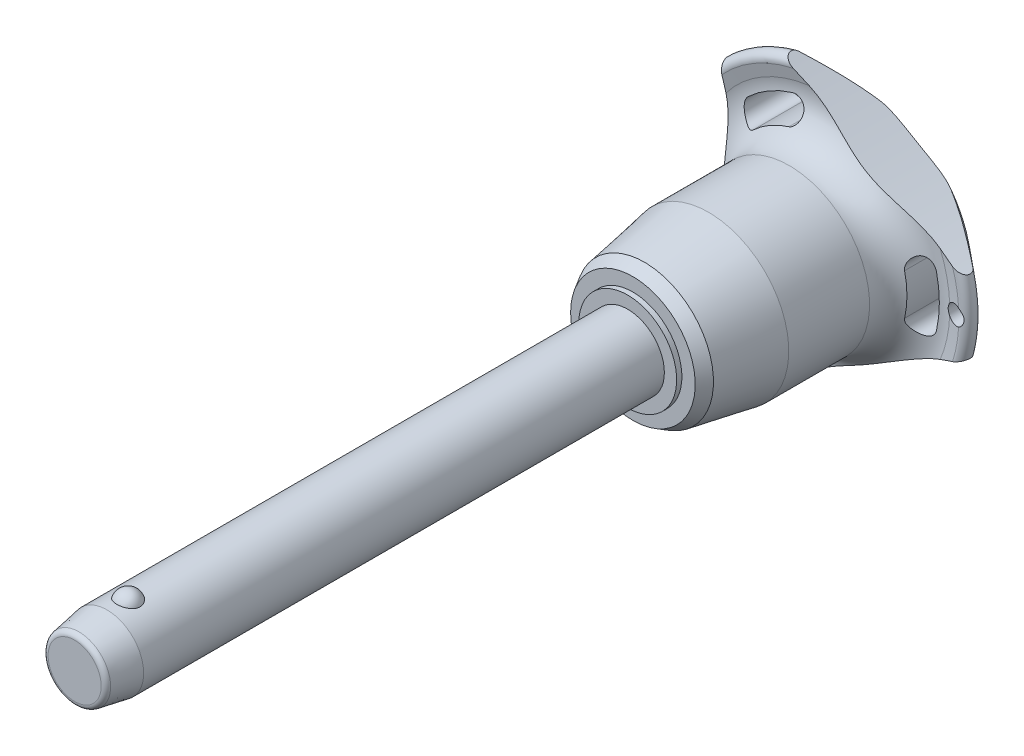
from build123d import *

# Parameters (mm, degrees)
SKETCH1_R           = 6
BOSS_EXTRUDE1_DEPTH = 80
SKETCH2_R           = 5.15
BOSS_EXTRUDE2_DEPTH = 39.7
BOSS_EXTRUDE3_START = 10.6
SKETCH1_2_R         = 6
BOSS_EXTRUDE3_DEPTH = 10.6
CHAMFER1_SIZE       = 5.3
CHAMFER1_SIZE2      = 0.934532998
FILLET1_R           = 0.85
SKETCH6_R           = 144.275
CUT_EXTRUDE1_DEPTH  = 125.345019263
CIRPATTERN1_COUNT   = 3
SKETCH7_R           = 1.5
CUT_EXTRUDE2_DEPTH  = 125.183516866


with BuildPart() as part:
    # Sketch1 → Boss-Extrude1 (new body)
    with BuildSketch(Plane.XY):
        Circle(SKETCH1_R)
    extrude(amount=-BOSS_EXTRUDE1_DEPTH)

    # Sketch2 → Boss-Extrude2 (add)
    with BuildSketch(Plane(origin=(0, 0, -80), x_dir=(-1, 0, 0), z_dir=(0, 0, -1))):
        Circle(SKETCH2_R)
    extrude(amount=BOSS_EXTRUDE2_DEPTH)

    # Sketch3 → Revolve1 (revolve)
    with BuildSketch(Plane(origin=(0, 0, 0), x_dir=(0, 0, -1), z_dir=(1, 0, 0))):
        with BuildLine():
            Line((-1.854049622, 7.25), (-1.854049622, 3.25))
            ThreePointArc((-1.854049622, 3.25), (0.145950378, 5.25), (-1.854049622, 7.25))
        make_face()
        with BuildLine():
            Line((-1.854049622, -3.25), (-1.854049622, -7.25))
            ThreePointArc((-1.854049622, -7.25), (0.145950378, -5.25), (-1.854049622, -3.25))
        make_face()
    revolve(axis=Axis((0, -3.25, 1.854049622), (0, 1, 0)))

    # Sketch1_2 → Boss-Extrude3 (add)
    with BuildSketch(Plane.XY.offset(BOSS_EXTRUDE3_START)):
        Circle(SKETCH1_2_R)
    extrude(amount=-BOSS_EXTRUDE3_DEPTH)

    # Chamfer1
    chamfer1_edges = [part.edges().sort_by_distance(p)[0] for p in [
        (-6, 0, 10.6),
    ]]
    chamfer1_side = [part.faces().sort_by_distance(p)[0] for p in [
        (-6, 0, -34.7),
    ]]
    chamfer(chamfer1_edges, length=CHAMFER1_SIZE, length2=CHAMFER1_SIZE2, reference=chamfer1_side[0])

    # Fillet1
    fillet1_edges = [part.edges().sort_by_distance(p)[0] for p in [
        (-5.065467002, 0, 10.6),
        (5.15, 0, -119.7),
    ]]
    fillet(fillet1_edges, radius=FILLET1_R)

    # Sketch4 → Revolve2 (revolve)
    with BuildSketch(Plane(origin=(0, 0, 0), x_dir=(0, 0, -1), z_dir=(1, 0, 0)), mode=Mode.PRIVATE) as revolve2_sk:
        Polygon((80, 0), (80, 8.017240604), (80.85, 8.017240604), (80.85, 10.206249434), (82.745737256, 11.300753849), (93.233333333, 13.15), (106.466666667, 13.15), (106.466666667, 0), align=None)
    revolve(revolve2_sk.sketch.rotate(Axis((0, 0, -106.466666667), (0, 0, 1)), 90), axis=Axis((0, 0, -106.466666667), (0, 0, 1)))

    # Sketch5 → Revolve3 (revolve)
    with BuildSketch(Plane(origin=(0, 0, 0), x_dir=(0, 0, -1), z_dir=(1, 0, 0)), mode=Mode.PRIVATE) as revolve3_sk:
        with BuildLine():
            Line((112.32877039, 20.428960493), (111.910912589, 22.344207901))
            ThreePointArc((111.910912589, 22.344207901), (112.554394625, 23.677136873), (114.002586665, 23.371345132))
            Line((114.002586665, 23.371345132), (119.141488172, 17.247040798))
            ThreePointArc((119.141488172, 17.247040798), (119.7, 15.584758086), (118.978803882, 13.986322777))
            ThreePointArc((118.978803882, 13.986322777), (114.617427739, 7.589034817), (113.083333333, 0))
            Line((113.083333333, 0), (106.466666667, 0))
            Line((106.466666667, 0), (106.466666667, 13.15))
            ThreePointArc((106.466666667, 13.15), (111.139661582, 15.38660811), (112.32877039, 20.428960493))
        make_face()
    revolve(revolve3_sk.sketch.rotate(Axis((0, 0, -113.083333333), (0, 0, 1)), 90), axis=Axis((0, 0, -113.083333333), (0, 0, 1)))

    # Sketch6 → Cut-Extrude1 (cut, through all)
    with BuildSketch(Plane.XY):
        with Locations((-159.975, 0)):
            Circle(SKETCH6_R)
        with BuildLine():
            ThreePointArc((18.131206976, -4.190753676), (18.60922037, 0), (18.131206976, 4.190753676))
            ThreePointArc((18.131206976, 4.190753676), (15.94840906, 5.553949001), (14.585213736, 3.371151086))
            ThreePointArc((14.585213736, 3.371151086), (14.969740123, 0), (14.585213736, -3.371151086))
            ThreePointArc((14.585213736, -3.371151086), (15.94840906, -5.553949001), (18.131206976, -4.190753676))
        make_face()
    cut_extrude1 = extrude(amount=-CUT_EXTRUDE1_DEPTH, mode=Mode.SUBTRACT)

    # CirPattern1: Cut-Extrude1 ×3 about axis
    cirpattern1_axis = Axis((0, 0, 0), (0, 0, 1))
    for i in range(1, CIRPATTERN1_COUNT):
        add(cut_extrude1.rotate(cirpattern1_axis, i * 360 / CIRPATTERN1_COUNT), mode=Mode.SUBTRACT)

    # Sketch7 → Cut-Extrude2 (cut, through all)
    with BuildSketch(Plane.XY):
        with Locations(Location((21.60922037, 0, 0), (0, 0, 297.620773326))):
            Circle(SKETCH7_R)
    extrude(amount=-CUT_EXTRUDE2_DEPTH, mode=Mode.SUBTRACT)


solid = part.part
